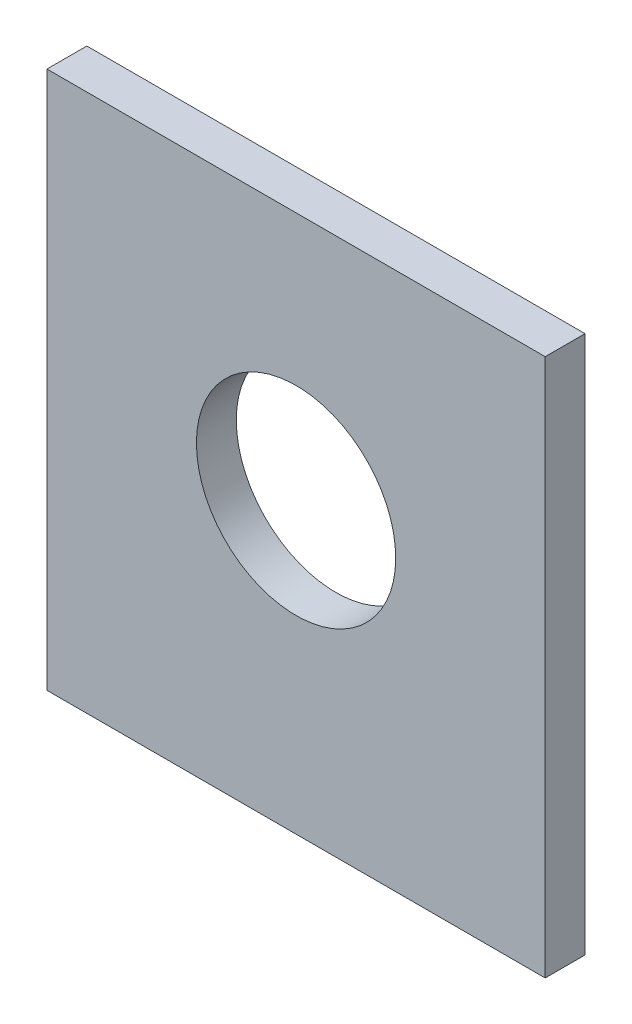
from build123d import *

# Parameters (mm, degrees)
SKETCH1_W          = 25
SKETCH1_H          = 27
EXTRUDE1_DEPTH     = 1
SKETCH2_R          = 5
CUT_EXTRUDE1_DEPTH = 2


with BuildPart() as part:
    # Sketch1 → Extrude1 (new, symmetric)
    with BuildSketch(Plane.XY):
        Rectangle(SKETCH1_W, SKETCH1_H)
    extrude(amount=EXTRUDE1_DEPTH, both=True)

    # Sketch2 → Cut-Extrude1 (cut)
    with BuildSketch(Plane.XY.offset(1)):
        with Locations((0, 1)):
            Circle(SKETCH2_R)
    extrude(amount=-CUT_EXTRUDE1_DEPTH, mode=Mode.SUBTRACT)


solid = part.part
